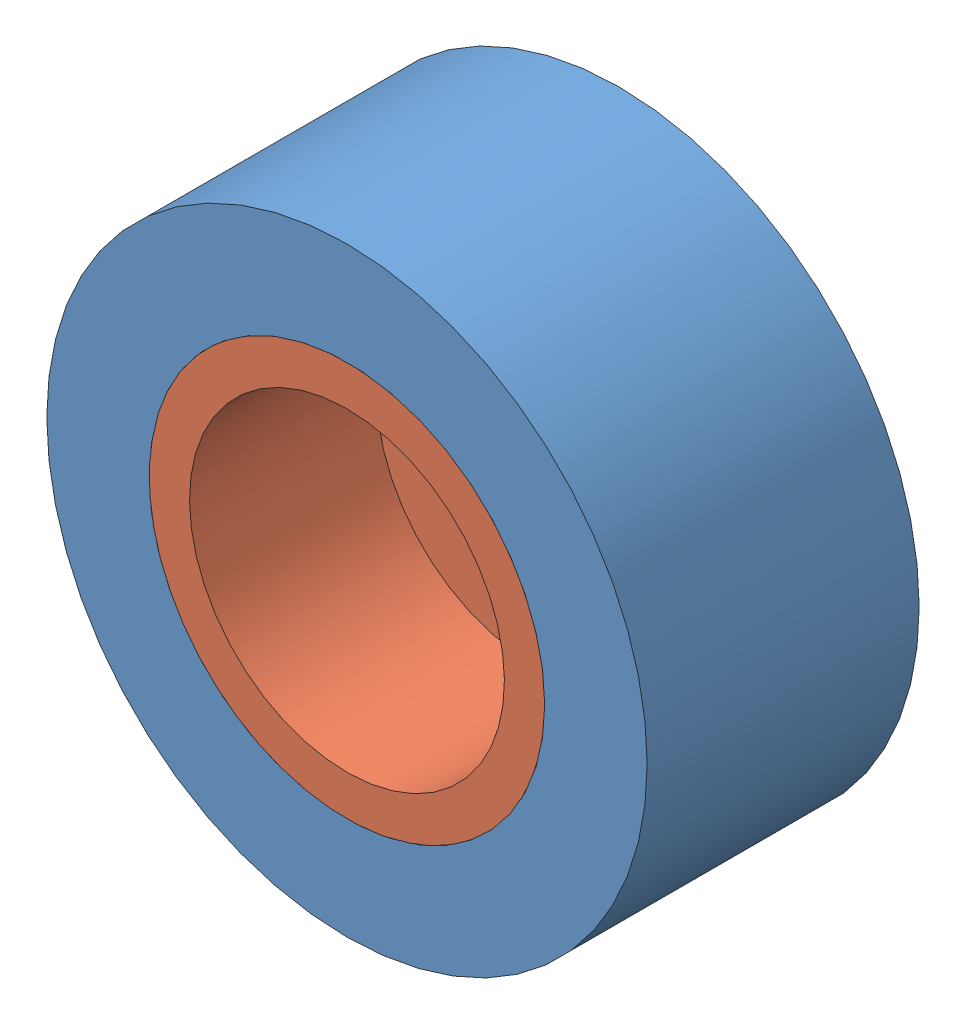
SolidWorks assembly koło_solarbotics.SLDASM, configuration Domyślna (file format 8000). Lengths in mm.
Overall size (28.6 28.6 13.12).
2 component instances, 2 part files, 3 mates.
Components (placement in the parent):
- opona solarbotics-1: opona solarbotics.SLDPRT [Domyślna] at (-8.1051 -0.3184 28.6) size (28.6 28.6 12.96)
- felga_solarbotics-1: felga_solarbotics.SLDPRT [Domyślna] at (-8.1051 -0.3184 28.44) x (0.847028 -0.531548 0) z (0 0 1) size (20.38 20.38 13.12)
Mates (geometry in assembly coordinates):
- Koncentryczne1: concentric aligned: cylinder of opona solarbotics-1 through (-8.1051 -0.3184 41.56) axis (0 0 -1) radius 14.3; cylinder of felga_solarbotics-1 through (-8.1051 -0.3184 36.46) axis (0 0 -1) radius 10.19
- Zablokuj1: lock: unknown of opona solarbotics-1; unknown of felga_solarbotics-1
- Wspólnie5: coincident anti-aligned: plane of opona solarbotics-1 through (-8.1051 -0.3184 33.7) normal (0 0 1); plane of felga_solarbotics-1 through (-8.1051 -0.3184 33.7) normal (0 0 -1)
